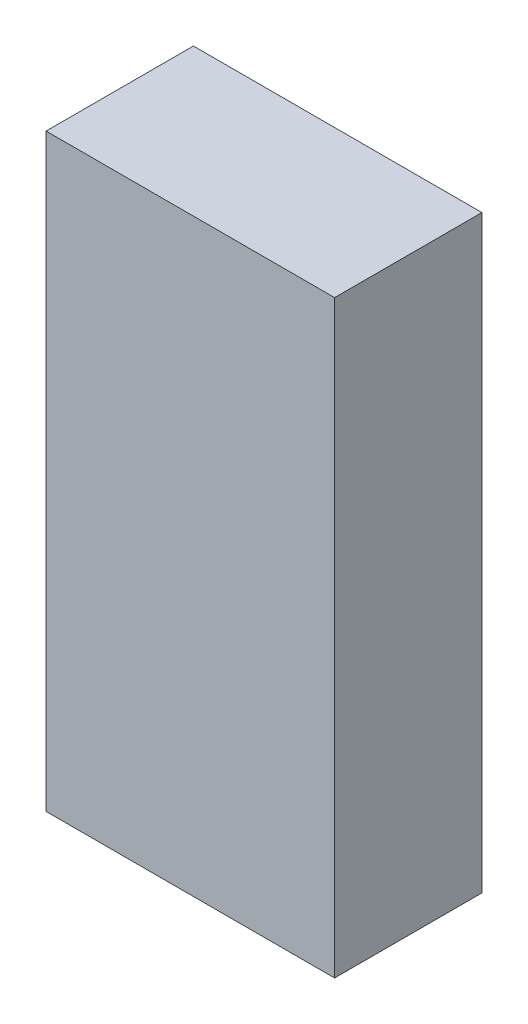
ISO-10303-21;
HEADER;
FILE_DESCRIPTION(('STEP AP214'),'2;1');
FILE_NAME('part.step','',(''),(''),'','','');
FILE_SCHEMA(('AUTOMOTIVE_DESIGN { 1 0 10303 214 1 1 1 1 }'));
ENDSEC;
DATA;
#1=APPLICATION_CONTEXT('core data for automotive mechanical design processes');
#2=APPLICATION_PROTOCOL_DEFINITION('international standard','automotive_design',2000,#1);
#3=PRODUCT_CONTEXT('',#1,'mechanical');
#4=PRODUCT('Part','Part','',(#3));
#5=PRODUCT_RELATED_PRODUCT_CATEGORY('part','',(#4));
#6=PRODUCT_DEFINITION_FORMATION('','',#4);
#7=PRODUCT_DEFINITION_CONTEXT('part definition',#1,'design');
#8=PRODUCT_DEFINITION('design','',#6,#7);
#9=PRODUCT_DEFINITION_SHAPE('','',#8);
#10=(LENGTH_UNIT() NAMED_UNIT(*) SI_UNIT(.MILLI.,.METRE.));
#11=(NAMED_UNIT(*) PLANE_ANGLE_UNIT() SI_UNIT($,.RADIAN.));
#12=(NAMED_UNIT(*) SI_UNIT($,.STERADIAN.) SOLID_ANGLE_UNIT());
#13=UNCERTAINTY_MEASURE_WITH_UNIT(LENGTH_MEASURE(1.E-05),#10,'distance_accuracy_value','');
#14=(GEOMETRIC_REPRESENTATION_CONTEXT(3) GLOBAL_UNCERTAINTY_ASSIGNED_CONTEXT((#13)) GLOBAL_UNIT_ASSIGNED_CONTEXT((#10,
#11,#12)) REPRESENTATION_CONTEXT('',''));
#15=CARTESIAN_POINT('',(0.,0.,0.));
#16=DIRECTION('',(0.,0.,1.));
#17=DIRECTION('',(1.,0.,0.));
#18=AXIS2_PLACEMENT_3D('',#15,#16,#17);
#19=CARTESIAN_POINT('',(0.,0.,152.4));
#20=DIRECTION('',(1.,0.,0.));
#21=DIRECTION('',(0.,0.,-1.));
#22=AXIS2_PLACEMENT_3D('',#19,#20,#21);
#23=PLANE('',#22);
#24=DIRECTION('',(0.,-1.,0.));
#25=VECTOR('',#24,1.);
#26=CARTESIAN_POINT('',(0.,0.,0.));
#27=LINE('',#26,#25);
#28=CARTESIAN_POINT('',(0.,609.6,0.));
#29=VERTEX_POINT('',#28);
#30=CARTESIAN_POINT('',(0.,0.,0.));
#31=VERTEX_POINT('',#30);
#32=EDGE_CURVE('E96',#29,#31,#27,.T.);
#33=ORIENTED_EDGE('',*,*,#32,.T.);
#34=DIRECTION('',(0.,0.,-1.));
#35=VECTOR('',#34,1.);
#36=CARTESIAN_POINT('',(0.,0.,152.4));
#37=LINE('',#36,#35);
#38=CARTESIAN_POINT('',(0.,0.,152.4));
#39=VERTEX_POINT('',#38);
#40=EDGE_CURVE('E11',#39,#31,#37,.T.);
#41=ORIENTED_EDGE('',*,*,#40,.F.);
#42=DIRECTION('',(0.,-1.,0.));
#43=VECTOR('',#42,1.);
#44=CARTESIAN_POINT('',(0.,0.,152.4));
#45=LINE('',#44,#43);
#46=CARTESIAN_POINT('',(0.,609.6,152.4));
#47=VERTEX_POINT('',#46);
#48=EDGE_CURVE('E84',#47,#39,#45,.T.);
#49=ORIENTED_EDGE('',*,*,#48,.F.);
#50=DIRECTION('',(0.,0.,-1.));
#51=VECTOR('',#50,1.);
#52=CARTESIAN_POINT('',(0.,609.6,152.4));
#53=LINE('',#52,#51);
#54=EDGE_CURVE('E92',#47,#29,#53,.T.);
#55=ORIENTED_EDGE('',*,*,#54,.T.);
#56=EDGE_LOOP('',(#33,#41,#49,#55));
#57=FACE_BOUND('',#56,.T.);
#58=ADVANCED_FACE('F33',(#57),#23,.F.);
#59=CARTESIAN_POINT('',(0.,0.,152.4));
#60=DIRECTION('',(0.,1.,0.));
#61=DIRECTION('',(0.,0.,1.));
#62=AXIS2_PLACEMENT_3D('',#59,#60,#61);
#63=PLANE('',#62);
#64=DIRECTION('',(1.,0.,0.));
#65=VECTOR('',#64,1.);
#66=CARTESIAN_POINT('',(0.,0.,0.));
#67=LINE('',#66,#65);
#68=CARTESIAN_POINT('',(298.45,0.,0.));
#69=VERTEX_POINT('',#68);
#70=EDGE_CURVE('E88',#31,#69,#67,.T.);
#71=ORIENTED_EDGE('',*,*,#70,.T.);
#72=DIRECTION('',(0.,0.,-1.));
#73=VECTOR('',#72,1.);
#74=CARTESIAN_POINT('',(298.45,0.,152.4));
#75=LINE('',#74,#73);
#76=CARTESIAN_POINT('',(298.45,0.,152.4));
#77=VERTEX_POINT('',#76);
#78=EDGE_CURVE('E41',#77,#69,#75,.T.);
#79=ORIENTED_EDGE('',*,*,#78,.F.);
#80=DIRECTION('',(1.,0.,0.));
#81=VECTOR('',#80,1.);
#82=CARTESIAN_POINT('',(0.,0.,152.4));
#83=LINE('',#82,#81);
#84=EDGE_CURVE('E79',#39,#77,#83,.T.);
#85=ORIENTED_EDGE('',*,*,#84,.F.);
#86=ORIENTED_EDGE('',*,*,#40,.T.);
#87=EDGE_LOOP('',(#71,#79,#85,#86));
#88=FACE_BOUND('',#87,.T.);
#89=ADVANCED_FACE('F87',(#88),#63,.F.);
#90=CARTESIAN_POINT('',(298.45,0.,152.4));
#91=DIRECTION('',(-1.,0.,0.));
#92=DIRECTION('',(0.,0.,1.));
#93=AXIS2_PLACEMENT_3D('',#90,#91,#92);
#94=PLANE('',#93);
#95=DIRECTION('',(0.,1.,0.));
#96=VECTOR('',#95,1.);
#97=CARTESIAN_POINT('',(298.45,0.,0.));
#98=LINE('',#97,#96);
#99=CARTESIAN_POINT('',(298.45,609.6,0.));
#100=VERTEX_POINT('',#99);
#101=EDGE_CURVE('E66',#69,#100,#98,.T.);
#102=ORIENTED_EDGE('',*,*,#101,.T.);
#103=DIRECTION('',(0.,0.,-1.));
#104=VECTOR('',#103,1.);
#105=CARTESIAN_POINT('',(298.45,609.6,152.4));
#106=LINE('',#105,#104);
#107=CARTESIAN_POINT('',(298.45,609.6,152.4));
#108=VERTEX_POINT('',#107);
#109=EDGE_CURVE('E89',#108,#100,#106,.T.);
#110=ORIENTED_EDGE('',*,*,#109,.F.);
#111=DIRECTION('',(0.,1.,0.));
#112=VECTOR('',#111,1.);
#113=CARTESIAN_POINT('',(298.45,0.,152.4));
#114=LINE('',#113,#112);
#115=EDGE_CURVE('E82',#77,#108,#114,.T.);
#116=ORIENTED_EDGE('',*,*,#115,.F.);
#117=ORIENTED_EDGE('',*,*,#78,.T.);
#118=EDGE_LOOP('',(#102,#110,#116,#117));
#119=FACE_BOUND('',#118,.T.);
#120=ADVANCED_FACE('F90',(#119),#94,.F.);
#121=CARTESIAN_POINT('',(0.,609.6,152.4));
#122=DIRECTION('',(0.,-1.,0.));
#123=DIRECTION('',(0.,0.,-1.));
#124=AXIS2_PLACEMENT_3D('',#121,#122,#123);
#125=PLANE('',#124);
#126=DIRECTION('',(-1.,0.,0.));
#127=VECTOR('',#126,1.);
#128=CARTESIAN_POINT('',(0.,609.6,0.));
#129=LINE('',#128,#127);
#130=EDGE_CURVE('E72',#100,#29,#129,.T.);
#131=ORIENTED_EDGE('',*,*,#130,.T.);
#132=ORIENTED_EDGE('',*,*,#54,.F.);
#133=DIRECTION('',(-1.,0.,0.));
#134=VECTOR('',#133,1.);
#135=CARTESIAN_POINT('',(0.,609.6,152.4));
#136=LINE('',#135,#134);
#137=EDGE_CURVE('E49',#108,#47,#136,.T.);
#138=ORIENTED_EDGE('',*,*,#137,.F.);
#139=ORIENTED_EDGE('',*,*,#109,.T.);
#140=EDGE_LOOP('',(#131,#132,#138,#139));
#141=FACE_BOUND('',#140,.T.);
#142=ADVANCED_FACE('F103',(#141),#125,.F.);
#143=CARTESIAN_POINT('',(0.,0.,152.4));
#144=DIRECTION('',(0.,0.,-1.));
#145=DIRECTION('',(-1.,0.,0.));
#146=AXIS2_PLACEMENT_3D('',#143,#144,#145);
#147=PLANE('',#146);
#148=ORIENTED_EDGE('',*,*,#48,.T.);
#149=ORIENTED_EDGE('',*,*,#84,.T.);
#150=ORIENTED_EDGE('',*,*,#115,.T.);
#151=ORIENTED_EDGE('',*,*,#137,.T.);
#152=EDGE_LOOP('',(#148,#149,#150,#151));
#153=FACE_BOUND('',#152,.T.);
#154=ADVANCED_FACE('F80',(#153),#147,.F.);
#155=CARTESIAN_POINT('',(0.,0.,0.));
#156=DIRECTION('',(0.,0.,-1.));
#157=DIRECTION('',(-1.,0.,0.));
#158=AXIS2_PLACEMENT_3D('',#155,#156,#157);
#159=PLANE('',#158);
#160=ORIENTED_EDGE('',*,*,#32,.F.);
#161=ORIENTED_EDGE('',*,*,#130,.F.);
#162=ORIENTED_EDGE('',*,*,#101,.F.);
#163=ORIENTED_EDGE('',*,*,#70,.F.);
#164=EDGE_LOOP('',(#160,#161,#162,#163));
#165=FACE_BOUND('',#164,.T.);
#166=ADVANCED_FACE('F106',(#165),#159,.T.);
#167=CLOSED_SHELL('',(#58,#89,#120,#142,#154,#166));
#168=MANIFOLD_SOLID_BREP('B2',#167);
#169=ADVANCED_BREP_SHAPE_REPRESENTATION('',(#18,#168),#14);
#170=SHAPE_DEFINITION_REPRESENTATION(#9,#169);
ENDSEC;
END-ISO-10303-21;
